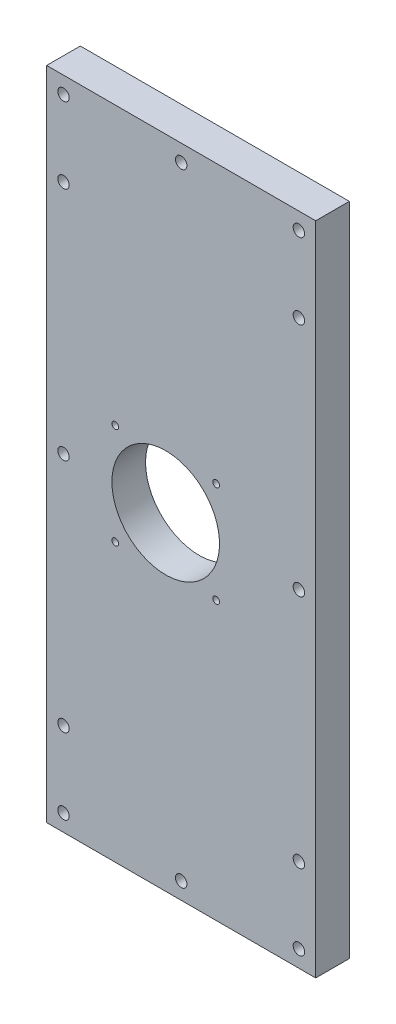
from build123d import *

# Parameters (mm, degrees)
SKIZZE1_W                       = 80
SKIZZE1_H                       = 195
AUFSATZ_LINEAR_AUSTRAGEN1_DEPTH = 10
SKIZZE2_R                       = 1
SKIZZE2_R_2                     = 16
SCHNITT_LINEAR_AUSTRAGEN1_DEPTH = 10
SKIZZE3_R                       = 3.5
SCHNITT_LINEAR_AUSTRAGEN2_DEPTH = 5
SKIZZE6_R                       = 1.7
SCHNITT_LINEAR_AUSTRAGEN4_DEPTH = 5


with BuildPart() as part:
    # Skizze1 → Aufsatz-Linear austragen1 (new body)
    with BuildSketch(Plane.XY):
        with Locations((-29.059385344, -27.400468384)):
            Rectangle(SKIZZE1_W, SKIZZE1_H)
    extrude(amount=-AUFSATZ_LINEAR_AUSTRAGEN1_DEPTH)

    # Skizze2 → Schnitt-Linear austragen1 (cut)
    with BuildSketch(Plane(origin=(0, 0, -10), x_dir=(-1, 0, 0), z_dir=(0, 0, -1))):
        with Locations((18.659385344, -12.400468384)):
            Circle(SKIZZE2_R)
        with Locations((48.659385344, -12.400468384)):
            Circle(SKIZZE2_R)
        with Locations((18.659385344, -42.400468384)):
            Circle(SKIZZE2_R)
        with Locations((48.659385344, -42.400468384)):
            Circle(SKIZZE2_R)
        with Locations((33.659385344, -27.400468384)):
            Circle(SKIZZE2_R_2)
    extrude(amount=-SCHNITT_LINEAR_AUSTRAGEN1_DEPTH, mode=Mode.SUBTRACT)

    # Skizze3 → Schnitt-Linear austragen2 (cut)
    with BuildSketch(Plane(origin=(0, 0, -10), x_dir=(-1, 0, 0), z_dir=(0, 0, -1))):
        with Locations((29.059385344, 65.099531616)):
            Circle(SKIZZE3_R)
        with Locations((-5.940614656, 65.099531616)):
            Circle(SKIZZE3_R)
        with Locations((64.059385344, 65.099531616)):
            Circle(SKIZZE3_R)
        with Locations((29.059385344, -119.900468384)):
            Circle(SKIZZE3_R)
        with Locations((-5.940614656, -119.900468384)):
            Circle(SKIZZE3_R)
        with Locations((64.059385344, -119.900468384)):
            Circle(SKIZZE3_R)
        with Locations((-5.940614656, 42.599531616)):
            Circle(SKIZZE3_R)
        with Locations((-5.940614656, -27.400468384)):
            Circle(SKIZZE3_R)
        with Locations((-5.940614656, -97.400468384)):
            Circle(SKIZZE3_R)
        with Locations((64.059385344, -97.400468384)):
            Circle(SKIZZE3_R)
        with Locations((64.059385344, -27.400468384)):
            Circle(SKIZZE3_R)
        with Locations((64.059385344, 42.599531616)):
            Circle(SKIZZE3_R)
    extrude(amount=-SCHNITT_LINEAR_AUSTRAGEN2_DEPTH, mode=Mode.SUBTRACT)

    # Skizze6 → Schnitt-Linear austragen4 (cut)
    with BuildSketch(Plane.XY):
        with Locations((-64.059385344, 65.099531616)):
            Circle(SKIZZE6_R)
        with Locations((-29.059385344, 65.099531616)):
            Circle(SKIZZE6_R)
        with Locations((5.940614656, 65.099531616)):
            Circle(SKIZZE6_R)
        with Locations((-64.059385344, 42.599531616)):
            Circle(SKIZZE6_R)
        with Locations((-64.059385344, -27.400468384)):
            Circle(SKIZZE6_R)
        with Locations((-64.059385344, -97.400468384)):
            Circle(SKIZZE6_R)
        with Locations((-64.059385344, -119.900468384)):
            Circle(SKIZZE6_R)
        with Locations((5.940614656, -119.900468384)):
            Circle(SKIZZE6_R)
        with Locations((5.940614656, -97.400468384)):
            Circle(SKIZZE6_R)
        with Locations((5.940614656, -27.400468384)):
            Circle(SKIZZE6_R)
        with Locations((5.940614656, 42.599531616)):
            Circle(SKIZZE6_R)
        with Locations((-29.059385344, -119.900468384)):
            Circle(SKIZZE6_R)
    extrude(amount=-SCHNITT_LINEAR_AUSTRAGEN4_DEPTH, mode=Mode.SUBTRACT)


solid = part.part
